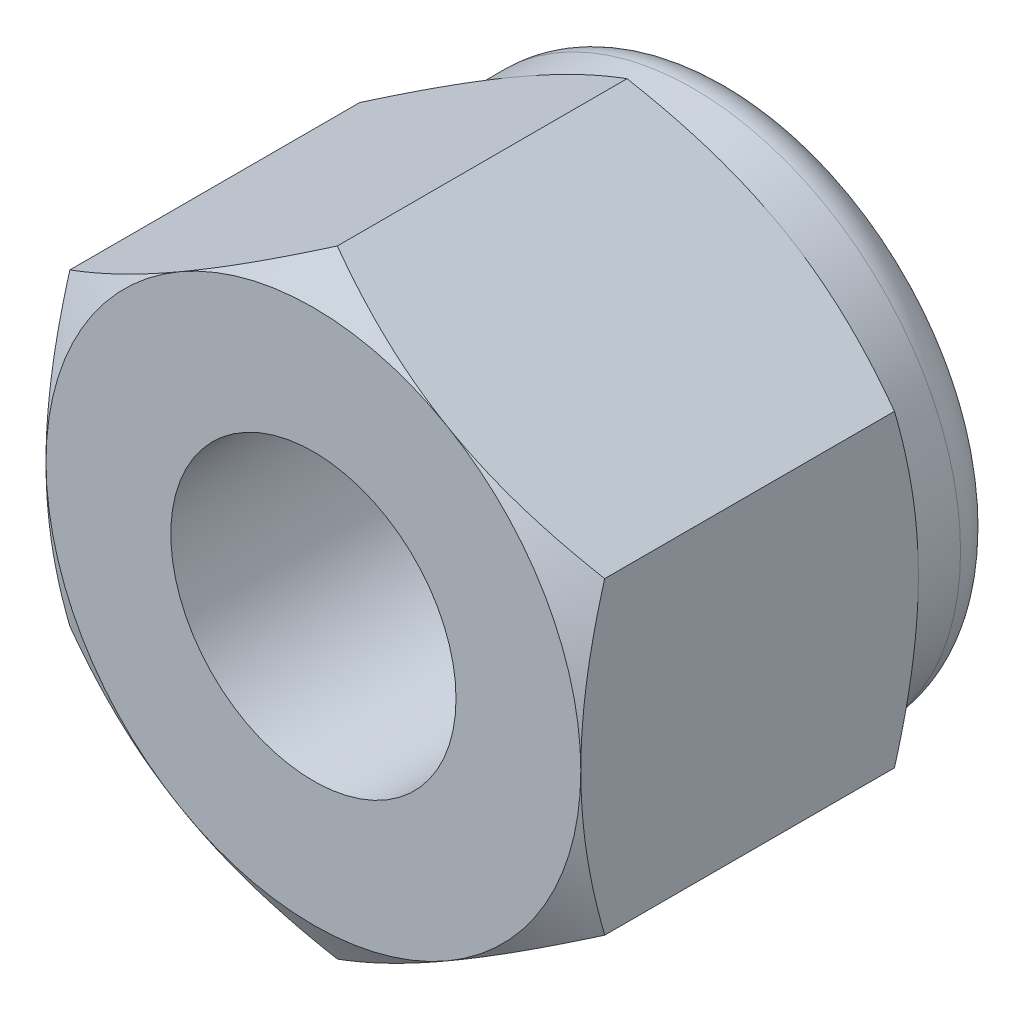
ISO-10303-21;
HEADER;
FILE_DESCRIPTION(('STEP AP214'),'2;1');
FILE_NAME('part.step','',(''),(''),'','','');
FILE_SCHEMA(('AUTOMOTIVE_DESIGN { 1 0 10303 214 1 1 1 1 }'));
ENDSEC;
DATA;
#1=APPLICATION_CONTEXT('core data for automotive mechanical design processes');
#2=APPLICATION_PROTOCOL_DEFINITION('international standard','automotive_design',2000,#1);
#3=PRODUCT_CONTEXT('',#1,'mechanical');
#4=PRODUCT('Part','Part','',(#3));
#5=PRODUCT_RELATED_PRODUCT_CATEGORY('part','',(#4));
#6=PRODUCT_DEFINITION_FORMATION('','',#4);
#7=PRODUCT_DEFINITION_CONTEXT('part definition',#1,'design');
#8=PRODUCT_DEFINITION('design','',#6,#7);
#9=PRODUCT_DEFINITION_SHAPE('','',#8);
#10=(LENGTH_UNIT() NAMED_UNIT(*) SI_UNIT(.MILLI.,.METRE.));
#11=(NAMED_UNIT(*) PLANE_ANGLE_UNIT() SI_UNIT($,.RADIAN.));
#12=(NAMED_UNIT(*) SI_UNIT($,.STERADIAN.) SOLID_ANGLE_UNIT());
#13=UNCERTAINTY_MEASURE_WITH_UNIT(LENGTH_MEASURE(1.E-05),#10,'distance_accuracy_value','');
#14=(GEOMETRIC_REPRESENTATION_CONTEXT(3) GLOBAL_UNCERTAINTY_ASSIGNED_CONTEXT((#13)) GLOBAL_UNIT_ASSIGNED_CONTEXT((#10,
#11,#12)) REPRESENTATION_CONTEXT('',''));
#15=CARTESIAN_POINT('',(0.,0.,0.));
#16=DIRECTION('',(0.,0.,1.));
#17=DIRECTION('',(1.,0.,0.));
#18=AXIS2_PLACEMENT_3D('',#15,#16,#17);
#19=CARTESIAN_POINT('',(-9.,15.5884572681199,0.));
#20=DIRECTION('',(0.,0.,-1.));
#21=DIRECTION('',(-1.,0.,0.));
#22=AXIS2_PLACEMENT_3D('',#19,#20,#21);
#23=PLANE('',#22);
#24=CARTESIAN_POINT('',(0.,0.,0.));
#25=DIRECTION('',(0.,0.,-1.));
#26=DIRECTION('',(-1.,0.,0.));
#27=AXIS2_PLACEMENT_3D('',#24,#25,#26);
#28=CIRCLE('',#27,9.);
#29=CARTESIAN_POINT('',(-9.,0.,0.));
#30=VERTEX_POINT('',#29);
#31=CARTESIAN_POINT('',(-4.5,7.79422863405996,0.));
#32=VERTEX_POINT('',#31);
#33=EDGE_CURVE('E158',#30,#32,#28,.T.);
#34=ORIENTED_EDGE('',*,*,#33,.F.);
#35=CARTESIAN_POINT('',(0.,0.,0.));
#36=DIRECTION('',(0.,0.,-1.));
#37=DIRECTION('',(-1.,0.,0.));
#38=AXIS2_PLACEMENT_3D('',#35,#36,#37);
#39=CIRCLE('',#38,9.);
#40=CARTESIAN_POINT('',(-4.49999999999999,-7.79422863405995,0.));
#41=VERTEX_POINT('',#40);
#42=EDGE_CURVE('E147',#30,#41,#39,.F.);
#43=ORIENTED_EDGE('',*,*,#42,.T.);
#44=CARTESIAN_POINT('',(4.49999999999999,-7.79422863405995,0.));
#45=VERTEX_POINT('',#44);
#46=EDGE_CURVE('E263',#41,#45,#39,.F.);
#47=ORIENTED_EDGE('',*,*,#46,.T.);
#48=CARTESIAN_POINT('',(9.,0.,0.));
#49=VERTEX_POINT('',#48);
#50=EDGE_CURVE('E268',#45,#49,#39,.F.);
#51=ORIENTED_EDGE('',*,*,#50,.T.);
#52=CARTESIAN_POINT('',(4.49999999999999,7.79422863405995,0.));
#53=VERTEX_POINT('',#52);
#54=EDGE_CURVE('E269',#49,#53,#39,.F.);
#55=ORIENTED_EDGE('',*,*,#54,.T.);
#56=EDGE_CURVE('E250',#53,#32,#39,.F.);
#57=ORIENTED_EDGE('',*,*,#56,.T.);
#58=EDGE_LOOP('',(#34,#43,#47,#51,#55,#57));
#59=FACE_BOUND('',#58,.T.);
#60=CARTESIAN_POINT('',(0.,0.,0.));
#61=DIRECTION('',(0.,0.,1.));
#62=DIRECTION('',(1.,0.,0.));
#63=AXIS2_PLACEMENT_3D('',#60,#61,#62);
#64=CIRCLE('',#63,4.8);
#65=CARTESIAN_POINT('',(4.8,0.,0.));
#66=VERTEX_POINT('',#65);
#67=EDGE_CURVE('E547',#66,#66,#64,.T.);
#68=ORIENTED_EDGE('',*,*,#67,.F.);
#69=EDGE_LOOP('',(#68));
#70=FACE_BOUND('',#69,.T.);
#71=ADVANCED_FACE('F34',(#59,#70),#23,.F.);
#72=CARTESIAN_POINT('',(0.,0.,0.));
#73=DIRECTION('',(0.,0.,-1.));
#74=DIRECTION('',(-1.,0.,0.));
#75=AXIS2_PLACEMENT_3D('',#72,#73,#74);
#76=CONICAL_SURFACE('',#75,9.,1.0471975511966);
#77=CARTESIAN_POINT('',(-9.,-14.0653890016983,-4.4446491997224));
#78=CARTESIAN_POINT('',(-9.,-13.6713285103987,-4.25306321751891));
#79=CARTESIAN_POINT('',(-9.,-13.2763748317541,-4.06328348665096));
#80=CARTESIAN_POINT('',(-9.,-12.4842063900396,-3.68835045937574));
#81=CARTESIAN_POINT('',(-9.,-12.0869912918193,-3.50319787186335));
#82=CARTESIAN_POINT('',(-9.,-11.2878306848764,-3.13762483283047));
#83=CARTESIAN_POINT('',(-9.,-10.885871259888,-2.95723469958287));
#84=CARTESIAN_POINT('',(-9.,-10.078792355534,-2.60369545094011));
#85=CARTESIAN_POINT('',(-9.,-9.67367302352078,-2.43054600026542));
#86=CARTESIAN_POINT('',(-9.,-8.84625540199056,-2.08785737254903));
#87=CARTESIAN_POINT('',(-9.,-8.4238299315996,-1.9186236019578));
#88=CARTESIAN_POINT('',(-9.,-7.57407827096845,-1.59270497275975));
#89=CARTESIAN_POINT('',(-9.,-7.14675154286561,-1.43602150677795));
#90=CARTESIAN_POINT('',(-9.,-6.28727729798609,-1.13923741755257));
#91=CARTESIAN_POINT('',(-9.,-5.85514116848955,-0.999104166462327));
#92=CARTESIAN_POINT('',(-9.,-4.98468673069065,-0.739843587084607));
#93=CARTESIAN_POINT('',(-9.,-4.54637038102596,-0.62070975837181));
#94=CARTESIAN_POINT('',(-9.,-3.66563092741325,-0.409725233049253));
#95=CARTESIAN_POINT('',(-9.,-3.22324436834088,-0.317726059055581));
#96=CARTESIAN_POINT('',(-9.,-2.55555164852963,-0.204018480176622));
#97=CARTESIAN_POINT('',(-9.,-2.33228668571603,-0.170163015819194));
#98=CARTESIAN_POINT('',(-9.,-1.88461070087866,-0.111210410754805));
#99=CARTESIAN_POINT('',(-9.,-1.66019979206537,-0.0861124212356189));
#100=CARTESIAN_POINT('',(-9.,-1.21351306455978,-0.0454954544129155));
#101=CARTESIAN_POINT('',(-9.,-0.991248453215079,-0.029853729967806));
#102=CARTESIAN_POINT('',(-9.,-0.546256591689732,-0.00798878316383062));
#103=CARTESIAN_POINT('',(-9.,-0.323529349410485,-0.00176540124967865));
#104=CARTESIAN_POINT('',(-9.,0.12199050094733,0.00111401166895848));
#105=CARTESIAN_POINT('',(-9.,0.344783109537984,-0.00223003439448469));
#106=CARTESIAN_POINT('',(-9.,0.790026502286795,-0.0184024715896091));
#107=CARTESIAN_POINT('',(-9.,1.0124772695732,-0.0312313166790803));
#108=CARTESIAN_POINT('',(-9.,1.54375703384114,-0.0729227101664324));
#109=CARTESIAN_POINT('',(-9.,1.85225489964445,-0.106099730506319));
#110=CARTESIAN_POINT('',(-9.,2.46701766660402,-0.188910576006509));
#111=CARTESIAN_POINT('',(-9.,2.77328227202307,-0.238546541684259));
#112=CARTESIAN_POINT('',(-9.,3.68833555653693,-0.409515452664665));
#113=CARTESIAN_POINT('',(-9.,4.29306527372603,-0.552881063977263));
#114=CARTESIAN_POINT('',(-9.,5.19764184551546,-0.802264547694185));
#115=CARTESIAN_POINT('',(-9.,5.50215678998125,-0.892329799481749));
#116=CARTESIAN_POINT('',(-9.,6.10822983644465,-1.08200162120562));
#117=CARTESIAN_POINT('',(-9.,6.40978791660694,-1.18160826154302));
#118=CARTESIAN_POINT('',(-9.,7.01004150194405,-1.38874893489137));
#119=CARTESIAN_POINT('',(-9.,7.3087378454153,-1.49628056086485));
#120=CARTESIAN_POINT('',(-9.,7.90364018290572,-1.71798708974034));
#121=CARTESIAN_POINT('',(-9.,8.19984622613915,-1.83216186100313));
#122=CARTESIAN_POINT('',(-9.,8.97334628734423,-2.13868688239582));
#123=CARTESIAN_POINT('',(-9.,9.44885064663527,-2.33554814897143));
#124=CARTESIAN_POINT('',(-9.,10.3951846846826,-2.74024038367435));
#125=CARTESIAN_POINT('',(-9.,10.8660139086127,-2.94807240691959));
#126=CARTESIAN_POINT('',(-9.,11.804024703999,-3.37219935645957));
#127=CARTESIAN_POINT('',(-9.,12.2712049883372,-3.58849712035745));
#128=CARTESIAN_POINT('',(-9.,13.202466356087,-4.02760284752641));
#129=CARTESIAN_POINT('',(-9.,13.6665475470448,-4.25041058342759));
#130=CARTESIAN_POINT('',(-9.,14.5928804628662,-4.70149362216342));
#131=CARTESIAN_POINT('',(-9.,15.055128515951,-4.92977645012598));
#132=CARTESIAN_POINT('',(-9.,15.9775681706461,-5.39046131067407));
#133=CARTESIAN_POINT('',(-9.,16.4377597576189,-5.6228633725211));
#134=CARTESIAN_POINT('',(-9.,17.3563529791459,-6.09095503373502));
#135=CARTESIAN_POINT('',(-9.,17.8147549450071,-6.32664398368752));
#136=CARTESIAN_POINT('',(-9.,18.7301433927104,-6.80075634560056));
#137=CARTESIAN_POINT('',(-9.,19.1871298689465,-7.03917976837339));
#138=CARTESIAN_POINT('',(-9.,20.464664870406,-7.70972549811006));
#139=CARTESIAN_POINT('',(-9.,21.2838901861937,-8.1443683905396));
#140=CARTESIAN_POINT('',(-9.,22.9195396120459,-9.01898683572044));
#141=CARTESIAN_POINT('',(-9.,23.7359635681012,-9.45896267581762));
#142=CARTESIAN_POINT('',(-9.,25.3641053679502,-10.3415393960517));
#143=CARTESIAN_POINT('',(-9.,26.1758299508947,-10.7841278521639));
#144=CARTESIAN_POINT('',(-9.,27.3921282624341,-11.4502920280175));
#145=CARTESIAN_POINT('',(-9.,27.7973319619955,-11.6727190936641));
#146=CARTESIAN_POINT('',(-9.,28.6073636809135,-12.1182550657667));
#147=CARTESIAN_POINT('',(-9.,29.0121917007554,-12.3413639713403));
#148=CARTESIAN_POINT('',(-9.,29.4168545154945,-12.5647721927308));
#149=B_SPLINE_CURVE_WITH_KNOTS('',3,(#77,#78,#79,#80,#81,#82,#83,#84,#85,#86,#87,#88,#89,#90,
#91,#92,#93,#94,#95,#96,#97,#98,#99,#100,#101,#102,#103,#104,#105,#106,#107,#108,#109,#110,#111,
#112,#113,#114,#115,#116,#117,#118,#119,#120,#121,#122,#123,#124,#125,#126,#127,#128,#129,#130,
#131,#132,#133,#134,#135,#136,#137,#138,#139,#140,#141,#142,#143,#144,#145,#146,#147,#148),
.UNSPECIFIED.,.F.,.F.,(4,2,2,2,2,2,2,2,2,2,2,2,2,2,2,2,2,2,2,2,2,2,2,2,2,2,2,2,2,2,2,2,2,2,2,4),
(0.,1.31451154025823,2.62922324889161,3.9509101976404,5.27253587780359,6.63757338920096,
8.00276216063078,9.36521294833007,10.7272412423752,12.0816722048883,12.7589793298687,
13.4362207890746,14.1044712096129,14.7727103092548,15.4409547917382,16.1092312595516,
17.0395383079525,17.9699663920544,19.8317773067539,20.7843594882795,21.7369486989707,
22.689249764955,23.6415319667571,25.1852634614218,26.7291436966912,28.27354592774,
29.8178942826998,31.3645029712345,32.9111226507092,34.4574409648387,36.0037653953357,
38.7858925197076,41.568170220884,44.3417926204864,45.7285057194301,47.1152170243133),.UNSPECIFIED.);
#150=CARTESIAN_POINT('',(-9.,5.19615242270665,-0.803847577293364));
#151=VERTEX_POINT('',#150);
#152=EDGE_CURVE('E175',#151,#30,#149,.F.);
#153=ORIENTED_EDGE('',*,*,#152,.T.);
#154=ORIENTED_EDGE('',*,*,#33,.T.);
#155=CARTESIAN_POINT('',(0.000199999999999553,10.3924203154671,-0.803914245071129));
#156=CARTESIAN_POINT('',(-0.197607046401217,10.2782163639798,-0.737982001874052));
#157=CARTESIAN_POINT('',(-0.396185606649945,10.1635669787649,-0.67504140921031));
#158=CARTESIAN_POINT('',(-0.794955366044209,9.93333715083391,-0.555968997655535));
#159=CARTESIAN_POINT('',(-0.99514722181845,9.81775632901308,-0.499840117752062));
#160=CARTESIAN_POINT('',(-1.3975150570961,9.58544915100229,-0.395151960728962));
#161=CARTESIAN_POINT('',(-1.5996945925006,9.46872074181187,-0.346610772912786));
#162=CARTESIAN_POINT('',(-2.00542875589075,9.23447001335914,-0.258148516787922));
#163=CARTESIAN_POINT('',(-2.20898309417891,9.11694786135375,-0.218225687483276));
#164=CARTESIAN_POINT('',(-2.61230590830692,8.88408932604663,-0.148684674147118));
#165=CARTESIAN_POINT('',(-2.812044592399,8.76877014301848,-0.118837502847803));
#166=CARTESIAN_POINT('',(-3.212415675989,8.53761579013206,-0.0687933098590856));
#167=CARTESIAN_POINT('',(-3.41304799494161,8.42178066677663,-0.0485954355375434));
#168=CARTESIAN_POINT('',(-3.81466063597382,8.18990950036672,-0.0183543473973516));
#169=CARTESIAN_POINT('',(-4.01564030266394,8.07387383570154,-0.00829960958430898));
#170=CARTESIAN_POINT('',(-4.41778459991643,7.84169571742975,0.00143766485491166));
#171=CARTESIAN_POINT('',(-4.61894922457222,7.72555326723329,0.00112052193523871));
#172=CARTESIAN_POINT('',(-4.9950326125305,7.50842142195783,-0.00916395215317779));
#173=CARTESIAN_POINT('',(-5.16997789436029,7.40741671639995,-0.0178767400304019));
#174=CARTESIAN_POINT('',(-5.51945867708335,7.20564389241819,-0.042977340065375));
#175=CARTESIAN_POINT('',(-5.69399414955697,7.10487579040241,-0.0593656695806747));
#176=CARTESIAN_POINT('',(-6.21692487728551,6.80296159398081,-0.119656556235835));
#177=CARTESIAN_POINT('',(-6.56439451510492,6.60234990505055,-0.174677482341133));
#178=CARTESIAN_POINT('',(-7.263019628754,6.19899850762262,-0.312230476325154));
#179=CARTESIAN_POINT('',(-7.61408594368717,5.99631027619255,-0.395345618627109));
#180=CARTESIAN_POINT('',(-8.3109833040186,5.59395639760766,-0.583982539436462));
#181=CARTESIAN_POINT('',(-8.65682327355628,5.39428559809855,-0.689460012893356));
#182=CARTESIAN_POINT('',(-9.0002,5.19603695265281,-0.803914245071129));
#183=B_SPLINE_CURVE_WITH_KNOTS('',3,(#155,#156,#157,#158,#159,#160,#161,#162,#163,#164,#165,
#166,#167,#168,#169,#170,#171,#172,#173,#174,#175,#176,#177,#178,#179,#180,#181,#182),
.UNSPECIFIED.,.F.,.F.,(4,2,2,2,2,2,2,2,2,2,2,2,2,4),(0.,0.713219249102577,1.42674513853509,
2.14194697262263,2.8570025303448,3.55449749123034,4.25193080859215,4.94857085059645,
5.64518936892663,6.25162976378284,6.8581110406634,8.07193747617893,9.31268391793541,
10.5509947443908),.UNSPECIFIED.);
#184=EDGE_CURVE('E162',#32,#151,#183,.T.);
#185=ORIENTED_EDGE('',*,*,#184,.T.);
#186=EDGE_LOOP('',(#153,#154,#185));
#187=FACE_BOUND('',#186,.T.);
#188=ADVANCED_FACE('F182',(#187),#76,.T.);
#189=CARTESIAN_POINT('',(9.0002,5.19603695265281,-0.803914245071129));
#190=CARTESIAN_POINT('',(8.80239295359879,5.31024090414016,-0.737982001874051));
#191=CARTESIAN_POINT('',(8.60381439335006,5.42489028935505,-0.675041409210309));
#192=CARTESIAN_POINT('',(8.20504463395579,5.65512011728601,-0.555968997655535));
#193=CARTESIAN_POINT('',(8.00485277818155,5.77070093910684,-0.499840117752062));
#194=CARTESIAN_POINT('',(7.6024849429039,6.00300811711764,-0.395151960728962));
#195=CARTESIAN_POINT('',(7.4003054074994,6.11973652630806,-0.346610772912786));
#196=CARTESIAN_POINT('',(6.99457124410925,6.35398725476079,-0.258148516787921));
#197=CARTESIAN_POINT('',(6.79101690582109,6.47150940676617,-0.218225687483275));
#198=CARTESIAN_POINT('',(6.38769409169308,6.7043679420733,-0.148684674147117));
#199=CARTESIAN_POINT('',(6.18795540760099,6.81968712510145,-0.118837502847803));
#200=CARTESIAN_POINT('',(5.787584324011,7.05084147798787,-0.0687933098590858));
#201=CARTESIAN_POINT('',(5.58695200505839,7.1666766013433,-0.0485954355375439));
#202=CARTESIAN_POINT('',(5.18533936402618,7.3985477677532,-0.0183543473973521));
#203=CARTESIAN_POINT('',(4.98435969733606,7.51458343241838,-0.00829960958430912));
#204=CARTESIAN_POINT('',(4.58221540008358,7.74676155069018,0.0014376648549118));
#205=CARTESIAN_POINT('',(4.38105077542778,7.86290400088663,0.00112052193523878));
#206=CARTESIAN_POINT('',(4.0049673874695,8.08003584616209,-0.00916395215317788));
#207=CARTESIAN_POINT('',(3.83002210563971,8.18104055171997,-0.017876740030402));
#208=CARTESIAN_POINT('',(3.48054132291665,8.38281337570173,-0.0429773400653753));
#209=CARTESIAN_POINT('',(3.30600585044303,8.48358147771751,-0.059365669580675));
#210=CARTESIAN_POINT('',(2.78307512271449,8.78549567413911,-0.119656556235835));
#211=CARTESIAN_POINT('',(2.43560548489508,8.98610736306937,-0.174677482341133));
#212=CARTESIAN_POINT('',(1.736980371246,9.3894587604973,-0.312230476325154));
#213=CARTESIAN_POINT('',(1.38591405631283,9.59214699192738,-0.395345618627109));
#214=CARTESIAN_POINT('',(0.689016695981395,9.99450087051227,-0.583982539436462));
#215=CARTESIAN_POINT('',(0.343176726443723,10.1941716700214,-0.689460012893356));
#216=CARTESIAN_POINT('',(-0.000199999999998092,10.3924203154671,-0.803914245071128));
#217=B_SPLINE_CURVE_WITH_KNOTS('',3,(#189,#190,#191,#192,#193,#194,#195,#196,#197,#198,#199,
#200,#201,#202,#203,#204,#205,#206,#207,#208,#209,#210,#211,#212,#213,#214,#215,#216),
.UNSPECIFIED.,.F.,.F.,(4,2,2,2,2,2,2,2,2,2,2,2,2,4),(0.,0.713219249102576,1.42674513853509,
2.14194697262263,2.85700253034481,3.55449749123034,4.25193080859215,4.94857085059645,
5.64518936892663,6.25162976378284,6.8581110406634,8.07193747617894,9.31268391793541,
10.5509947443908),.UNSPECIFIED.);
#218=CARTESIAN_POINT('',(0.,10.3923048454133,-0.803847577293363));
#219=VERTEX_POINT('',#218);
#220=EDGE_CURVE('E200',#53,#219,#217,.T.);
#221=ORIENTED_EDGE('',*,*,#220,.T.);
#222=EDGE_CURVE('E174',#219,#32,#183,.T.);
#223=ORIENTED_EDGE('',*,*,#222,.T.);
#224=ORIENTED_EDGE('',*,*,#56,.F.);
#225=EDGE_LOOP('',(#221,#223,#224));
#226=FACE_BOUND('',#225,.T.);
#227=ADVANCED_FACE('F187',(#226),#76,.T.);
#228=CARTESIAN_POINT('',(9.,-14.0653890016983,-4.4446491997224));
#229=CARTESIAN_POINT('',(9.,-13.6713285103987,-4.25306321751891));
#230=CARTESIAN_POINT('',(9.,-13.2763748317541,-4.06328348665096));
#231=CARTESIAN_POINT('',(9.,-12.4842063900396,-3.68835045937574));
#232=CARTESIAN_POINT('',(9.,-12.0869912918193,-3.50319787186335));
#233=CARTESIAN_POINT('',(9.,-11.2878306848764,-3.13762483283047));
#234=CARTESIAN_POINT('',(9.,-10.885871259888,-2.95723469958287));
#235=CARTESIAN_POINT('',(9.,-10.078792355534,-2.60369545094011));
#236=CARTESIAN_POINT('',(9.,-9.67367302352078,-2.43054600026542));
#237=CARTESIAN_POINT('',(9.,-8.84625540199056,-2.08785737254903));
#238=CARTESIAN_POINT('',(9.,-8.4238299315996,-1.9186236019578));
#239=CARTESIAN_POINT('',(9.,-7.57407827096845,-1.59270497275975));
#240=CARTESIAN_POINT('',(9.,-7.14675154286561,-1.43602150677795));
#241=CARTESIAN_POINT('',(9.,-6.28727729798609,-1.13923741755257));
#242=CARTESIAN_POINT('',(9.,-5.85514116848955,-0.999104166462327));
#243=CARTESIAN_POINT('',(9.,-4.98468673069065,-0.739843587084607));
#244=CARTESIAN_POINT('',(9.,-4.54637038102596,-0.62070975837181));
#245=CARTESIAN_POINT('',(9.,-3.66563092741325,-0.409725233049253));
#246=CARTESIAN_POINT('',(9.,-3.22324436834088,-0.317726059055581));
#247=CARTESIAN_POINT('',(9.,-2.55555164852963,-0.204018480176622));
#248=CARTESIAN_POINT('',(9.,-2.33228668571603,-0.170163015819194));
#249=CARTESIAN_POINT('',(9.,-1.88461070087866,-0.111210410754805));
#250=CARTESIAN_POINT('',(9.,-1.66019979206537,-0.0861124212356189));
#251=CARTESIAN_POINT('',(9.,-1.21351306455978,-0.0454954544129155));
#252=CARTESIAN_POINT('',(9.,-0.991248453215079,-0.029853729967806));
#253=CARTESIAN_POINT('',(9.,-0.546256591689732,-0.00798878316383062));
#254=CARTESIAN_POINT('',(9.,-0.323529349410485,-0.00176540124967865));
#255=CARTESIAN_POINT('',(9.,0.12199050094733,0.00111401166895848));
#256=CARTESIAN_POINT('',(9.,0.344783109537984,-0.00223003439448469));
#257=CARTESIAN_POINT('',(9.,0.790026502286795,-0.0184024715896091));
#258=CARTESIAN_POINT('',(9.,1.0124772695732,-0.0312313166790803));
#259=CARTESIAN_POINT('',(9.,1.54375703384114,-0.0729227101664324));
#260=CARTESIAN_POINT('',(9.,1.85225489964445,-0.106099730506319));
#261=CARTESIAN_POINT('',(9.,2.46701766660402,-0.188910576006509));
#262=CARTESIAN_POINT('',(9.,2.77328227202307,-0.238546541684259));
#263=CARTESIAN_POINT('',(9.,3.68833555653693,-0.409515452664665));
#264=CARTESIAN_POINT('',(9.,4.29306527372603,-0.552881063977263));
#265=CARTESIAN_POINT('',(9.,5.19764184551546,-0.802264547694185));
#266=CARTESIAN_POINT('',(9.,5.50215678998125,-0.892329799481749));
#267=CARTESIAN_POINT('',(9.,6.10822983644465,-1.08200162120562));
#268=CARTESIAN_POINT('',(9.,6.40978791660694,-1.18160826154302));
#269=CARTESIAN_POINT('',(9.,7.01004150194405,-1.38874893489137));
#270=CARTESIAN_POINT('',(9.,7.3087378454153,-1.49628056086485));
#271=CARTESIAN_POINT('',(9.,7.90364018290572,-1.71798708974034));
#272=CARTESIAN_POINT('',(9.,8.19984622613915,-1.83216186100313));
#273=CARTESIAN_POINT('',(9.,8.97334628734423,-2.13868688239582));
#274=CARTESIAN_POINT('',(9.,9.44885064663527,-2.33554814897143));
#275=CARTESIAN_POINT('',(9.,10.3951846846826,-2.74024038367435));
#276=CARTESIAN_POINT('',(9.,10.8660139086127,-2.94807240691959));
#277=CARTESIAN_POINT('',(9.,11.804024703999,-3.37219935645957));
#278=CARTESIAN_POINT('',(9.,12.2712049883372,-3.58849712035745));
#279=CARTESIAN_POINT('',(9.,13.202466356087,-4.02760284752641));
#280=CARTESIAN_POINT('',(9.,13.6665475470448,-4.25041058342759));
#281=CARTESIAN_POINT('',(9.,14.5928804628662,-4.70149362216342));
#282=CARTESIAN_POINT('',(9.,15.055128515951,-4.92977645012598));
#283=CARTESIAN_POINT('',(9.,15.9775681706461,-5.39046131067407));
#284=CARTESIAN_POINT('',(9.,16.4377597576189,-5.6228633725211));
#285=CARTESIAN_POINT('',(9.,17.3563529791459,-6.09095503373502));
#286=CARTESIAN_POINT('',(9.,17.8147549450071,-6.32664398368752));
#287=CARTESIAN_POINT('',(9.,18.7301433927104,-6.80075634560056));
#288=CARTESIAN_POINT('',(9.,19.1871298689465,-7.03917976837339));
#289=CARTESIAN_POINT('',(9.,20.464664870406,-7.70972549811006));
#290=CARTESIAN_POINT('',(9.,21.2838901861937,-8.1443683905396));
#291=CARTESIAN_POINT('',(9.,22.9195396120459,-9.01898683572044));
#292=CARTESIAN_POINT('',(9.,23.7359635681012,-9.45896267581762));
#293=CARTESIAN_POINT('',(9.,25.3641053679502,-10.3415393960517));
#294=CARTESIAN_POINT('',(9.,26.1758299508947,-10.7841278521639));
#295=CARTESIAN_POINT('',(9.,27.3921282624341,-11.4502920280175));
#296=CARTESIAN_POINT('',(9.,27.7973319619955,-11.6727190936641));
#297=CARTESIAN_POINT('',(9.,28.6073636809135,-12.1182550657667));
#298=CARTESIAN_POINT('',(9.,29.0121917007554,-12.3413639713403));
#299=CARTESIAN_POINT('',(9.,29.4168545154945,-12.5647721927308));
#300=B_SPLINE_CURVE_WITH_KNOTS('',3,(#228,#229,#230,#231,#232,#233,#234,#235,#236,#237,#238,
#239,#240,#241,#242,#243,#244,#245,#246,#247,#248,#249,#250,#251,#252,#253,#254,#255,#256,#257,
#258,#259,#260,#261,#262,#263,#264,#265,#266,#267,#268,#269,#270,#271,#272,#273,#274,#275,#276,
#277,#278,#279,#280,#281,#282,#283,#284,#285,#286,#287,#288,#289,#290,#291,#292,#293,#294,#295,
#296,#297,#298,#299),.UNSPECIFIED.,.F.,.F.,(4,2,2,2,2,2,2,2,2,2,2,2,2,2,2,2,2,2,2,2,2,2,2,2,2,2,
2,2,2,2,2,2,2,2,2,4),(0.,1.31451154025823,2.62922324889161,3.9509101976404,5.27253587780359,
6.63757338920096,8.00276216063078,9.36521294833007,10.7272412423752,12.0816722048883,
12.7589793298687,13.4362207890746,14.1044712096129,14.7727103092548,15.4409547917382,
16.1092312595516,17.0395383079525,17.9699663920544,19.8317773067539,20.7843594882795,
21.7369486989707,22.689249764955,23.6415319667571,25.1852634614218,26.7291436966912,
28.27354592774,29.8178942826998,31.3645029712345,32.9111226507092,34.4574409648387,
36.0037653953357,38.7858925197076,41.568170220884,44.3417926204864,45.7285057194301,
47.1152170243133),.UNSPECIFIED.);
#301=CARTESIAN_POINT('',(9.,5.19615242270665,-0.803847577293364));
#302=VERTEX_POINT('',#301);
#303=EDGE_CURVE('E211',#49,#302,#300,.T.);
#304=ORIENTED_EDGE('',*,*,#303,.T.);
#305=EDGE_CURVE('E288',#302,#53,#217,.T.);
#306=ORIENTED_EDGE('',*,*,#305,.T.);
#307=ORIENTED_EDGE('',*,*,#54,.F.);
#308=EDGE_LOOP('',(#304,#306,#307));
#309=FACE_BOUND('',#308,.T.);
#310=ADVANCED_FACE('F287',(#309),#76,.T.);
#311=CARTESIAN_POINT('',(-0.000199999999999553,-10.3924203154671,-0.803914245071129));
#312=CARTESIAN_POINT('',(0.197607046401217,-10.2782163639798,-0.737982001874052));
#313=CARTESIAN_POINT('',(0.396185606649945,-10.1635669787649,-0.67504140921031));
#314=CARTESIAN_POINT('',(0.794955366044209,-9.93333715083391,-0.555968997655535));
#315=CARTESIAN_POINT('',(0.99514722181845,-9.81775632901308,-0.499840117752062));
#316=CARTESIAN_POINT('',(1.3975150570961,-9.58544915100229,-0.395151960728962));
#317=CARTESIAN_POINT('',(1.5996945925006,-9.46872074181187,-0.346610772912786));
#318=CARTESIAN_POINT('',(2.00542875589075,-9.23447001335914,-0.258148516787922));
#319=CARTESIAN_POINT('',(2.20898309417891,-9.11694786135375,-0.218225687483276));
#320=CARTESIAN_POINT('',(2.61230590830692,-8.88408932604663,-0.148684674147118));
#321=CARTESIAN_POINT('',(2.812044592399,-8.76877014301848,-0.118837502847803));
#322=CARTESIAN_POINT('',(3.212415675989,-8.53761579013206,-0.0687933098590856));
#323=CARTESIAN_POINT('',(3.41304799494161,-8.42178066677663,-0.0485954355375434));
#324=CARTESIAN_POINT('',(3.81466063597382,-8.18990950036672,-0.0183543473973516));
#325=CARTESIAN_POINT('',(4.01564030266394,-8.07387383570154,-0.00829960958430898));
#326=CARTESIAN_POINT('',(4.41778459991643,-7.84169571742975,0.00143766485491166));
#327=CARTESIAN_POINT('',(4.61894922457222,-7.72555326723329,0.00112052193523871));
#328=CARTESIAN_POINT('',(4.9950326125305,-7.50842142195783,-0.00916395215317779));
#329=CARTESIAN_POINT('',(5.16997789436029,-7.40741671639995,-0.0178767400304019));
#330=CARTESIAN_POINT('',(5.51945867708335,-7.20564389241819,-0.042977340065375));
#331=CARTESIAN_POINT('',(5.69399414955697,-7.10487579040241,-0.0593656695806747));
#332=CARTESIAN_POINT('',(6.21692487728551,-6.80296159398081,-0.119656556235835));
#333=CARTESIAN_POINT('',(6.56439451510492,-6.60234990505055,-0.174677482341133));
#334=CARTESIAN_POINT('',(7.263019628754,-6.19899850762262,-0.312230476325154));
#335=CARTESIAN_POINT('',(7.61408594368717,-5.99631027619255,-0.395345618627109));
#336=CARTESIAN_POINT('',(8.3109833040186,-5.59395639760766,-0.583982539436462));
#337=CARTESIAN_POINT('',(8.65682327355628,-5.39428559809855,-0.689460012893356));
#338=CARTESIAN_POINT('',(9.0002,-5.19603695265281,-0.803914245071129));
#339=B_SPLINE_CURVE_WITH_KNOTS('',3,(#311,#312,#313,#314,#315,#316,#317,#318,#319,#320,#321,
#322,#323,#324,#325,#326,#327,#328,#329,#330,#331,#332,#333,#334,#335,#336,#337,#338),
.UNSPECIFIED.,.F.,.F.,(4,2,2,2,2,2,2,2,2,2,2,2,2,4),(0.,0.713219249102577,1.42674513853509,
2.14194697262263,2.8570025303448,3.55449749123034,4.25193080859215,4.94857085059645,
5.64518936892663,6.25162976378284,6.8581110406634,8.07193747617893,9.31268391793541,
10.5509947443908),.UNSPECIFIED.);
#340=CARTESIAN_POINT('',(9.,-5.19615242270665,-0.803847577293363));
#341=VERTEX_POINT('',#340);
#342=EDGE_CURVE('E217',#45,#341,#339,.T.);
#343=ORIENTED_EDGE('',*,*,#342,.T.);
#344=EDGE_CURVE('E216',#341,#49,#300,.T.);
#345=ORIENTED_EDGE('',*,*,#344,.T.);
#346=ORIENTED_EDGE('',*,*,#50,.F.);
#347=EDGE_LOOP('',(#343,#345,#346));
#348=FACE_BOUND('',#347,.T.);
#349=ADVANCED_FACE('F311',(#348),#76,.T.);
#350=CARTESIAN_POINT('',(0.,-10.3923048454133,-0.803847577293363));
#351=VERTEX_POINT('',#350);
#352=EDGE_CURVE('E137',#351,#45,#339,.T.);
#353=ORIENTED_EDGE('',*,*,#352,.T.);
#354=ORIENTED_EDGE('',*,*,#46,.F.);
#355=CARTESIAN_POINT('',(-9.0002,-5.19603695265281,-0.803914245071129));
#356=CARTESIAN_POINT('',(-8.80239295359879,-5.31024090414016,-0.737982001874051));
#357=CARTESIAN_POINT('',(-8.60381439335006,-5.42489028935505,-0.675041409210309));
#358=CARTESIAN_POINT('',(-8.20504463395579,-5.65512011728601,-0.555968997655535));
#359=CARTESIAN_POINT('',(-8.00485277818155,-5.77070093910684,-0.499840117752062));
#360=CARTESIAN_POINT('',(-7.6024849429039,-6.00300811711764,-0.395151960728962));
#361=CARTESIAN_POINT('',(-7.4003054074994,-6.11973652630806,-0.346610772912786));
#362=CARTESIAN_POINT('',(-6.99457124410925,-6.35398725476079,-0.258148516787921));
#363=CARTESIAN_POINT('',(-6.79101690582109,-6.47150940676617,-0.218225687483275));
#364=CARTESIAN_POINT('',(-6.38769409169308,-6.7043679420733,-0.148684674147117));
#365=CARTESIAN_POINT('',(-6.18795540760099,-6.81968712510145,-0.118837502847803));
#366=CARTESIAN_POINT('',(-5.787584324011,-7.05084147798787,-0.0687933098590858));
#367=CARTESIAN_POINT('',(-5.58695200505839,-7.1666766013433,-0.0485954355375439));
#368=CARTESIAN_POINT('',(-5.18533936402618,-7.3985477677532,-0.0183543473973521));
#369=CARTESIAN_POINT('',(-4.98435969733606,-7.51458343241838,-0.00829960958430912));
#370=CARTESIAN_POINT('',(-4.58221540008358,-7.74676155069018,0.0014376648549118));
#371=CARTESIAN_POINT('',(-4.38105077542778,-7.86290400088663,0.00112052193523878));
#372=CARTESIAN_POINT('',(-4.0049673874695,-8.08003584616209,-0.00916395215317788));
#373=CARTESIAN_POINT('',(-3.83002210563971,-8.18104055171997,-0.017876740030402));
#374=CARTESIAN_POINT('',(-3.48054132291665,-8.38281337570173,-0.0429773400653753));
#375=CARTESIAN_POINT('',(-3.30600585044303,-8.48358147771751,-0.059365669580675));
#376=CARTESIAN_POINT('',(-2.78307512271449,-8.78549567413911,-0.119656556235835));
#377=CARTESIAN_POINT('',(-2.43560548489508,-8.98610736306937,-0.174677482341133));
#378=CARTESIAN_POINT('',(-1.736980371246,-9.3894587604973,-0.312230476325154));
#379=CARTESIAN_POINT('',(-1.38591405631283,-9.59214699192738,-0.395345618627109));
#380=CARTESIAN_POINT('',(-0.689016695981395,-9.99450087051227,-0.583982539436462));
#381=CARTESIAN_POINT('',(-0.343176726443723,-10.1941716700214,-0.689460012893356));
#382=CARTESIAN_POINT('',(0.000199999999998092,-10.3924203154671,-0.803914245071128));
#383=B_SPLINE_CURVE_WITH_KNOTS('',3,(#355,#356,#357,#358,#359,#360,#361,#362,#363,#364,#365,
#366,#367,#368,#369,#370,#371,#372,#373,#374,#375,#376,#377,#378,#379,#380,#381,#382),
.UNSPECIFIED.,.F.,.F.,(4,2,2,2,2,2,2,2,2,2,2,2,2,4),(0.,0.713219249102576,1.42674513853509,
2.14194697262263,2.85700253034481,3.55449749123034,4.25193080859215,4.94857085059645,
5.64518936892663,6.25162976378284,6.8581110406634,8.07193747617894,9.31268391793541,
10.5509947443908),.UNSPECIFIED.);
#384=EDGE_CURVE('E308',#41,#351,#383,.T.);
#385=ORIENTED_EDGE('',*,*,#384,.T.);
#386=EDGE_LOOP('',(#353,#354,#385));
#387=FACE_BOUND('',#386,.T.);
#388=ADVANCED_FACE('F189',(#387),#76,.T.);
#389=CARTESIAN_POINT('',(-9.,-5.19615242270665,-0.803847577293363));
#390=VERTEX_POINT('',#389);
#391=EDGE_CURVE('E205',#390,#41,#383,.T.);
#392=ORIENTED_EDGE('',*,*,#391,.T.);
#393=ORIENTED_EDGE('',*,*,#42,.F.);
#394=EDGE_CURVE('E291',#30,#390,#149,.F.);
#395=ORIENTED_EDGE('',*,*,#394,.T.);
#396=EDGE_LOOP('',(#392,#393,#395));
#397=FACE_BOUND('',#396,.T.);
#398=ADVANCED_FACE('F304',(#397),#76,.T.);
#399=CARTESIAN_POINT('',(9.,5.19615242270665,-11.36));
#400=DIRECTION('',(0.499999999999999,0.866025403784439,0.));
#401=DIRECTION('',(-0.866025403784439,0.499999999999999,0.));
#402=AXIS2_PLACEMENT_3D('',#399,#400,#401);
#403=PLANE('',#402);
#404=CARTESIAN_POINT('',(-0.000199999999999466,10.3924203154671,-10.5560857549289));
#405=CARTESIAN_POINT('',(0.197607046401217,10.2782163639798,-10.6220179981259));
#406=CARTESIAN_POINT('',(0.396185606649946,10.1635669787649,-10.6849585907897));
#407=CARTESIAN_POINT('',(0.794955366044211,9.93333715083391,-10.8040310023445));
#408=CARTESIAN_POINT('',(0.995147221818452,9.81775632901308,-10.8601598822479));
#409=CARTESIAN_POINT('',(1.3975150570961,9.58544915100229,-10.964848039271));
#410=CARTESIAN_POINT('',(1.5996945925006,9.46872074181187,-11.0133892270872));
#411=CARTESIAN_POINT('',(2.00542875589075,9.23447001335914,-11.1018514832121));
#412=CARTESIAN_POINT('',(2.20898309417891,9.11694786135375,-11.1417743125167));
#413=CARTESIAN_POINT('',(2.61230590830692,8.88408932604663,-11.2113153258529));
#414=CARTESIAN_POINT('',(2.81204459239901,8.76877014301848,-11.2411624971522));
#415=CARTESIAN_POINT('',(3.212415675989,8.53761579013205,-11.2912066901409));
#416=CARTESIAN_POINT('',(3.41304799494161,8.42178066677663,-11.3114045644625));
#417=CARTESIAN_POINT('',(3.81466063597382,8.18990950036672,-11.3416456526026));
#418=CARTESIAN_POINT('',(4.01564030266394,8.07387383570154,-11.3517003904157));
#419=CARTESIAN_POINT('',(4.41778459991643,7.84169571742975,-11.3614376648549));
#420=CARTESIAN_POINT('',(4.61894922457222,7.72555326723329,-11.3611205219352));
#421=CARTESIAN_POINT('',(4.9950326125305,7.50842142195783,-11.3508360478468));
#422=CARTESIAN_POINT('',(5.16997789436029,7.40741671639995,-11.3421232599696));
#423=CARTESIAN_POINT('',(5.51945867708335,7.20564389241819,-11.3170226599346));
#424=CARTESIAN_POINT('',(5.69399414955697,7.10487579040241,-11.3006343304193));
#425=CARTESIAN_POINT('',(6.21692487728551,6.80296159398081,-11.2403434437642));
#426=CARTESIAN_POINT('',(6.56439451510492,6.60234990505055,-11.1853225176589));
#427=CARTESIAN_POINT('',(7.263019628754,6.19899850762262,-11.0477695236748));
#428=CARTESIAN_POINT('',(7.61408594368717,5.99631027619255,-10.9646543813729));
#429=CARTESIAN_POINT('',(8.31098330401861,5.59395639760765,-10.7760174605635));
#430=CARTESIAN_POINT('',(8.65682327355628,5.39428559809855,-10.6705399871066));
#431=CARTESIAN_POINT('',(9.0002,5.19603695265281,-10.5560857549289));
#432=B_SPLINE_CURVE_WITH_KNOTS('',3,(#404,#405,#406,#407,#408,#409,#410,#411,#412,#413,#414,
#415,#416,#417,#418,#419,#420,#421,#422,#423,#424,#425,#426,#427,#428,#429,#430,#431),
.UNSPECIFIED.,.F.,.F.,(4,2,2,2,2,2,2,2,2,2,2,2,2,4),(0.,0.713219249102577,1.42674513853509,
2.14194697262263,2.85700253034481,3.55449749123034,4.25193080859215,4.94857085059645,
5.64518936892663,6.25162976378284,6.8581110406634,8.07193747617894,9.31268391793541,
10.5509947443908),.UNSPECIFIED.);
#433=CARTESIAN_POINT('',(0.,10.3923048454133,-10.5561524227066));
#434=VERTEX_POINT('',#433);
#435=CARTESIAN_POINT('',(4.49999999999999,7.79422863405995,-11.36));
#436=VERTEX_POINT('',#435);
#437=EDGE_CURVE('E141',#434,#436,#432,.T.);
#438=ORIENTED_EDGE('',*,*,#437,.F.);
#439=DIRECTION('',(0.,0.,1.));
#440=VECTOR('',#439,1.);
#441=CARTESIAN_POINT('',(0.,10.3923048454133,-11.36));
#442=LINE('',#441,#440);
#443=EDGE_CURVE('E134',#434,#219,#442,.T.);
#444=ORIENTED_EDGE('',*,*,#443,.T.);
#445=ORIENTED_EDGE('',*,*,#220,.F.);
#446=ORIENTED_EDGE('',*,*,#305,.F.);
#447=DIRECTION('',(0.,0.,1.));
#448=VECTOR('',#447,1.);
#449=CARTESIAN_POINT('',(9.,5.19615242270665,-11.36));
#450=LINE('',#449,#448);
#451=CARTESIAN_POINT('',(9.,5.19615242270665,-10.5561524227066));
#452=VERTEX_POINT('',#451);
#453=EDGE_CURVE('E247',#452,#302,#450,.T.);
#454=ORIENTED_EDGE('',*,*,#453,.F.);
#455=EDGE_CURVE('E242',#436,#452,#432,.T.);
#456=ORIENTED_EDGE('',*,*,#455,.F.);
#457=EDGE_LOOP('',(#438,#444,#445,#446,#454,#456));
#458=FACE_BOUND('',#457,.T.);
#459=ADVANCED_FACE('F36',(#458),#403,.T.);
#460=CARTESIAN_POINT('',(9.,-5.19615242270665,-11.36));
#461=DIRECTION('',(1.,0.,0.));
#462=DIRECTION('',(0.,0.,-1.));
#463=AXIS2_PLACEMENT_3D('',#460,#461,#462);
#464=PLANE('',#463);
#465=CARTESIAN_POINT('',(9.,-14.0653890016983,-6.91535080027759));
#466=CARTESIAN_POINT('',(9.,-13.6713285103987,-7.10693678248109));
#467=CARTESIAN_POINT('',(9.,-13.2763748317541,-7.29671651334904));
#468=CARTESIAN_POINT('',(9.,-12.4842063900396,-7.67164954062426));
#469=CARTESIAN_POINT('',(9.,-12.0869912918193,-7.85680212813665));
#470=CARTESIAN_POINT('',(9.,-11.2878306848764,-8.22237516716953));
#471=CARTESIAN_POINT('',(9.,-10.885871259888,-8.40276530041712));
#472=CARTESIAN_POINT('',(9.,-10.078792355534,-8.75630454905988));
#473=CARTESIAN_POINT('',(9.,-9.67367302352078,-8.92945399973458));
#474=CARTESIAN_POINT('',(9.,-8.84625540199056,-9.27214262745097));
#475=CARTESIAN_POINT('',(9.,-8.4238299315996,-9.4413763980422));
#476=CARTESIAN_POINT('',(9.,-7.57407827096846,-9.76729502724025));
#477=CARTESIAN_POINT('',(9.,-7.14675154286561,-9.92397849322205));
#478=CARTESIAN_POINT('',(9.,-6.28727729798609,-10.2207625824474));
#479=CARTESIAN_POINT('',(9.,-5.85514116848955,-10.3608958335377));
#480=CARTESIAN_POINT('',(9.,-4.98468673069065,-10.6201564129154));
#481=CARTESIAN_POINT('',(9.,-4.54637038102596,-10.7392902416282));
#482=CARTESIAN_POINT('',(9.,-3.66563092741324,-10.9502747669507));
#483=CARTESIAN_POINT('',(9.,-3.22324436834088,-11.0422739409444));
#484=CARTESIAN_POINT('',(9.,-2.55555164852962,-11.1559815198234));
#485=CARTESIAN_POINT('',(9.,-2.33228668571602,-11.1898369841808));
#486=CARTESIAN_POINT('',(9.,-1.88461070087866,-11.2487895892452));
#487=CARTESIAN_POINT('',(9.,-1.66019979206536,-11.2738875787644));
#488=CARTESIAN_POINT('',(9.,-1.21351306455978,-11.3145045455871));
#489=CARTESIAN_POINT('',(9.,-0.991248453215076,-11.3301462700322));
#490=CARTESIAN_POINT('',(9.,-0.546256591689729,-11.3520112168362));
#491=CARTESIAN_POINT('',(9.,-0.323529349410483,-11.3582345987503));
#492=CARTESIAN_POINT('',(9.,0.121990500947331,-11.361114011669));
#493=CARTESIAN_POINT('',(9.,0.344783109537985,-11.3577699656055));
#494=CARTESIAN_POINT('',(9.,0.790026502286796,-11.3415975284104));
#495=CARTESIAN_POINT('',(9.,1.0124772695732,-11.3287686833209));
#496=CARTESIAN_POINT('',(9.,1.54375703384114,-11.2870772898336));
#497=CARTESIAN_POINT('',(9.,1.85225489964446,-11.2539002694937));
#498=CARTESIAN_POINT('',(9.,2.46701766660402,-11.1710894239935));
#499=CARTESIAN_POINT('',(9.,2.77328227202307,-11.1214534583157));
#500=CARTESIAN_POINT('',(9.,3.68833555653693,-10.9504845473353));
#501=CARTESIAN_POINT('',(9.,4.29306527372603,-10.8071189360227));
#502=CARTESIAN_POINT('',(9.,5.19764184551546,-10.5577354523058));
#503=CARTESIAN_POINT('',(9.,5.50215678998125,-10.4676702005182));
#504=CARTESIAN_POINT('',(9.,6.10822983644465,-10.2779983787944));
#505=CARTESIAN_POINT('',(9.,6.40978791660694,-10.178391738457));
#506=CARTESIAN_POINT('',(9.,7.01004150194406,-9.97125106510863));
#507=CARTESIAN_POINT('',(9.,7.3087378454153,-9.86371943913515));
#508=CARTESIAN_POINT('',(9.,7.90364018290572,-9.64201291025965));
#509=CARTESIAN_POINT('',(9.,8.19984622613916,-9.52783813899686));
#510=CARTESIAN_POINT('',(9.,8.97334628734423,-9.22131311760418));
#511=CARTESIAN_POINT('',(9.,9.44885064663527,-9.02445185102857));
#512=CARTESIAN_POINT('',(9.,10.3951846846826,-8.61975961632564));
#513=CARTESIAN_POINT('',(9.,10.8660139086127,-8.41192759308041));
#514=CARTESIAN_POINT('',(9.,11.804024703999,-7.98780064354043));
#515=CARTESIAN_POINT('',(9.,12.2712049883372,-7.77150287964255));
#516=CARTESIAN_POINT('',(9.,13.202466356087,-7.33239715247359));
#517=CARTESIAN_POINT('',(9.,13.6665475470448,-7.10958941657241));
#518=CARTESIAN_POINT('',(9.,14.5928804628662,-6.65850637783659));
#519=CARTESIAN_POINT('',(9.,15.0551285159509,-6.43022354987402));
#520=CARTESIAN_POINT('',(9.,15.9775681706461,-5.96953868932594));
#521=CARTESIAN_POINT('',(9.,16.4377597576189,-5.7371366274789));
#522=CARTESIAN_POINT('',(9.,17.3563529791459,-5.26904496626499));
#523=CARTESIAN_POINT('',(9.,17.8147549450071,-5.03335601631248));
#524=CARTESIAN_POINT('',(9.,18.7301433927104,-4.55924365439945));
#525=CARTESIAN_POINT('',(9.,19.1871298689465,-4.32082023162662));
#526=CARTESIAN_POINT('',(9.,20.464664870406,-3.65027450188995));
#527=CARTESIAN_POINT('',(9.,21.2838901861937,-3.21563160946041));
#528=CARTESIAN_POINT('',(9.,22.9195396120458,-2.34101316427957));
#529=CARTESIAN_POINT('',(9.,23.7359635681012,-1.90103732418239));
#530=CARTESIAN_POINT('',(9.,25.3641053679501,-1.01846060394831));
#531=CARTESIAN_POINT('',(9.,26.1758299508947,-0.575872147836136));
#532=CARTESIAN_POINT('',(9.,27.3921282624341,0.0902920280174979));
#533=CARTESIAN_POINT('',(9.,27.7973319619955,0.312719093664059));
#534=CARTESIAN_POINT('',(9.,28.6073636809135,0.758255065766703));
#535=CARTESIAN_POINT('',(9.,29.0121917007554,0.98136397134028));
#536=CARTESIAN_POINT('',(9.,29.4168545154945,1.20477219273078));
#537=B_SPLINE_CURVE_WITH_KNOTS('',3,(#465,#466,#467,#468,#469,#470,#471,#472,#473,#474,#475,
#476,#477,#478,#479,#480,#481,#482,#483,#484,#485,#486,#487,#488,#489,#490,#491,#492,#493,#494,
#495,#496,#497,#498,#499,#500,#501,#502,#503,#504,#505,#506,#507,#508,#509,#510,#511,#512,#513,
#514,#515,#516,#517,#518,#519,#520,#521,#522,#523,#524,#525,#526,#527,#528,#529,#530,#531,#532,
#533,#534,#535,#536),.UNSPECIFIED.,.F.,.F.,(4,2,2,2,2,2,2,2,2,2,2,2,2,2,2,2,2,2,2,2,2,2,2,2,2,2,
2,2,2,2,2,2,2,2,2,4),(0.,1.31451154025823,2.62922324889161,3.9509101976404,5.27253587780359,
6.63757338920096,8.00276216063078,9.36521294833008,10.7272412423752,12.0816722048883,
12.7589793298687,13.4362207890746,14.1044712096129,14.7727103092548,15.4409547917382,
16.1092312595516,17.0395383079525,17.9699663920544,19.8317773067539,20.7843594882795,
21.7369486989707,22.689249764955,23.6415319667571,25.1852634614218,26.7291436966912,
28.27354592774,29.8178942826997,31.3645029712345,32.9111226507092,34.4574409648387,
36.0037653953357,38.7858925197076,41.568170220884,44.3417926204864,45.7285057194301,
47.1152170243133),.UNSPECIFIED.);
#538=CARTESIAN_POINT('',(9.,0.,-11.36));
#539=VERTEX_POINT('',#538);
#540=EDGE_CURVE('E236',#452,#539,#537,.F.);
#541=ORIENTED_EDGE('',*,*,#540,.F.);
#542=ORIENTED_EDGE('',*,*,#453,.T.);
#543=ORIENTED_EDGE('',*,*,#303,.F.);
#544=ORIENTED_EDGE('',*,*,#344,.F.);
#545=DIRECTION('',(0.,0.,1.));
#546=VECTOR('',#545,1.);
#547=CARTESIAN_POINT('',(9.,-5.19615242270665,-11.36));
#548=LINE('',#547,#546);
#549=CARTESIAN_POINT('',(9.,-5.19615242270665,-10.5561524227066));
#550=VERTEX_POINT('',#549);
#551=EDGE_CURVE('E251',#550,#341,#548,.T.);
#552=ORIENTED_EDGE('',*,*,#551,.F.);
#553=EDGE_CURVE('E230',#539,#550,#537,.F.);
#554=ORIENTED_EDGE('',*,*,#553,.F.);
#555=EDGE_LOOP('',(#541,#542,#543,#544,#552,#554));
#556=FACE_BOUND('',#555,.T.);
#557=ADVANCED_FACE('F222',(#556),#464,.T.);
#558=CARTESIAN_POINT('',(9.,-5.19615242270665,-11.36));
#559=DIRECTION('',(0.499999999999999,-0.866025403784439,0.));
#560=DIRECTION('',(0.866025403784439,0.499999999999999,0.));
#561=AXIS2_PLACEMENT_3D('',#558,#559,#560);
#562=PLANE('',#561);
#563=CARTESIAN_POINT('',(9.0002,-5.19603695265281,-10.5560857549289));
#564=CARTESIAN_POINT('',(8.80239295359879,-5.31024090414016,-10.6220179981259));
#565=CARTESIAN_POINT('',(8.60381439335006,-5.42489028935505,-10.6849585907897));
#566=CARTESIAN_POINT('',(8.20504463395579,-5.65512011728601,-10.8040310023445));
#567=CARTESIAN_POINT('',(8.00485277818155,-5.77070093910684,-10.8601598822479));
#568=CARTESIAN_POINT('',(7.6024849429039,-6.00300811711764,-10.964848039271));
#569=CARTESIAN_POINT('',(7.4003054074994,-6.11973652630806,-11.0133892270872));
#570=CARTESIAN_POINT('',(6.99457124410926,-6.35398725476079,-11.1018514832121));
#571=CARTESIAN_POINT('',(6.79101690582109,-6.47150940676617,-11.1417743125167));
#572=CARTESIAN_POINT('',(6.38769409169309,-6.70436794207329,-11.2113153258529));
#573=CARTESIAN_POINT('',(6.187955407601,-6.81968712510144,-11.2411624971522));
#574=CARTESIAN_POINT('',(5.787584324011,-7.05084147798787,-11.2912066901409));
#575=CARTESIAN_POINT('',(5.58695200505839,-7.1666766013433,-11.3114045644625));
#576=CARTESIAN_POINT('',(5.18533936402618,-7.3985477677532,-11.3416456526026));
#577=CARTESIAN_POINT('',(4.98435969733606,-7.51458343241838,-11.3517003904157));
#578=CARTESIAN_POINT('',(4.58221540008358,-7.74676155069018,-11.3614376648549));
#579=CARTESIAN_POINT('',(4.38105077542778,-7.86290400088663,-11.3611205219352));
#580=CARTESIAN_POINT('',(4.0049673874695,-8.08003584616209,-11.3508360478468));
#581=CARTESIAN_POINT('',(3.83002210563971,-8.18104055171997,-11.3421232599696));
#582=CARTESIAN_POINT('',(3.48054132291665,-8.38281337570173,-11.3170226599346));
#583=CARTESIAN_POINT('',(3.30600585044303,-8.48358147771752,-11.3006343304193));
#584=CARTESIAN_POINT('',(2.7830751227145,-8.78549567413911,-11.2403434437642));
#585=CARTESIAN_POINT('',(2.43560548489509,-8.98610736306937,-11.1853225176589));
#586=CARTESIAN_POINT('',(1.736980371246,-9.3894587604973,-11.0477695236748));
#587=CARTESIAN_POINT('',(1.38591405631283,-9.59214699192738,-10.9646543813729));
#588=CARTESIAN_POINT('',(0.689016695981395,-9.99450087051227,-10.7760174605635));
#589=CARTESIAN_POINT('',(0.343176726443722,-10.1941716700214,-10.6705399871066));
#590=CARTESIAN_POINT('',(-0.000199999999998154,-10.3924203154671,-10.5560857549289));
#591=B_SPLINE_CURVE_WITH_KNOTS('',3,(#563,#564,#565,#566,#567,#568,#569,#570,#571,#572,#573,
#574,#575,#576,#577,#578,#579,#580,#581,#582,#583,#584,#585,#586,#587,#588,#589,#590),
.UNSPECIFIED.,.F.,.F.,(4,2,2,2,2,2,2,2,2,2,2,2,2,4),(0.,0.713219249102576,1.42674513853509,
2.14194697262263,2.8570025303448,3.55449749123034,4.25193080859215,4.94857085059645,
5.64518936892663,6.25162976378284,6.8581110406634,8.07193747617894,9.31268391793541,
10.5509947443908),.UNSPECIFIED.);
#592=CARTESIAN_POINT('',(4.49999999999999,-7.79422863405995,-11.36));
#593=VERTEX_POINT('',#592);
#594=EDGE_CURVE('E58',#550,#593,#591,.T.);
#595=ORIENTED_EDGE('',*,*,#594,.F.);
#596=ORIENTED_EDGE('',*,*,#551,.T.);
#597=ORIENTED_EDGE('',*,*,#342,.F.);
#598=ORIENTED_EDGE('',*,*,#352,.F.);
#599=DIRECTION('',(0.,0.,1.));
#600=VECTOR('',#599,1.);
#601=CARTESIAN_POINT('',(0.,-10.3923048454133,-11.36));
#602=LINE('',#601,#600);
#603=CARTESIAN_POINT('',(0.,-10.3923048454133,-10.5561524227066));
#604=VERTEX_POINT('',#603);
#605=EDGE_CURVE('E254',#604,#351,#602,.T.);
#606=ORIENTED_EDGE('',*,*,#605,.F.);
#607=EDGE_CURVE('E237',#593,#604,#591,.T.);
#608=ORIENTED_EDGE('',*,*,#607,.F.);
#609=EDGE_LOOP('',(#595,#596,#597,#598,#606,#608));
#610=FACE_BOUND('',#609,.T.);
#611=ADVANCED_FACE('F225',(#610),#562,.T.);
#612=CARTESIAN_POINT('',(-9.,-5.19615242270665,-11.36));
#613=DIRECTION('',(-0.499999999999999,-0.866025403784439,0.));
#614=DIRECTION('',(0.866025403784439,-0.499999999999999,0.));
#615=AXIS2_PLACEMENT_3D('',#612,#613,#614);
#616=PLANE('',#615);
#617=CARTESIAN_POINT('',(0.000199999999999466,-10.3924203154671,-10.5560857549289));
#618=CARTESIAN_POINT('',(-0.197607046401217,-10.2782163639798,-10.6220179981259));
#619=CARTESIAN_POINT('',(-0.396185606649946,-10.1635669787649,-10.6849585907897));
#620=CARTESIAN_POINT('',(-0.794955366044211,-9.93333715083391,-10.8040310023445));
#621=CARTESIAN_POINT('',(-0.995147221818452,-9.81775632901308,-10.8601598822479));
#622=CARTESIAN_POINT('',(-1.3975150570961,-9.58544915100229,-10.964848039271));
#623=CARTESIAN_POINT('',(-1.5996945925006,-9.46872074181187,-11.0133892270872));
#624=CARTESIAN_POINT('',(-2.00542875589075,-9.23447001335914,-11.1018514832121));
#625=CARTESIAN_POINT('',(-2.20898309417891,-9.11694786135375,-11.1417743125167));
#626=CARTESIAN_POINT('',(-2.61230590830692,-8.88408932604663,-11.2113153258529));
#627=CARTESIAN_POINT('',(-2.81204459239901,-8.76877014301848,-11.2411624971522));
#628=CARTESIAN_POINT('',(-3.212415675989,-8.53761579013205,-11.2912066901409));
#629=CARTESIAN_POINT('',(-3.41304799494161,-8.42178066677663,-11.3114045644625));
#630=CARTESIAN_POINT('',(-3.81466063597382,-8.18990950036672,-11.3416456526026));
#631=CARTESIAN_POINT('',(-4.01564030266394,-8.07387383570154,-11.3517003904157));
#632=CARTESIAN_POINT('',(-4.41778459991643,-7.84169571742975,-11.3614376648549));
#633=CARTESIAN_POINT('',(-4.61894922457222,-7.72555326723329,-11.3611205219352));
#634=CARTESIAN_POINT('',(-4.9950326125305,-7.50842142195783,-11.3508360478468));
#635=CARTESIAN_POINT('',(-5.16997789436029,-7.40741671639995,-11.3421232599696));
#636=CARTESIAN_POINT('',(-5.51945867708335,-7.20564389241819,-11.3170226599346));
#637=CARTESIAN_POINT('',(-5.69399414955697,-7.10487579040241,-11.3006343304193));
#638=CARTESIAN_POINT('',(-6.21692487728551,-6.80296159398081,-11.2403434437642));
#639=CARTESIAN_POINT('',(-6.56439451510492,-6.60234990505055,-11.1853225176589));
#640=CARTESIAN_POINT('',(-7.263019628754,-6.19899850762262,-11.0477695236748));
#641=CARTESIAN_POINT('',(-7.61408594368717,-5.99631027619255,-10.9646543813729));
#642=CARTESIAN_POINT('',(-8.31098330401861,-5.59395639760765,-10.7760174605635));
#643=CARTESIAN_POINT('',(-8.65682327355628,-5.39428559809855,-10.6705399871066));
#644=CARTESIAN_POINT('',(-9.0002,-5.19603695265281,-10.5560857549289));
#645=B_SPLINE_CURVE_WITH_KNOTS('',3,(#617,#618,#619,#620,#621,#622,#623,#624,#625,#626,#627,
#628,#629,#630,#631,#632,#633,#634,#635,#636,#637,#638,#639,#640,#641,#642,#643,#644),
.UNSPECIFIED.,.F.,.F.,(4,2,2,2,2,2,2,2,2,2,2,2,2,4),(0.,0.713219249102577,1.42674513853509,
2.14194697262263,2.85700253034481,3.55449749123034,4.25193080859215,4.94857085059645,
5.64518936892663,6.25162976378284,6.8581110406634,8.07193747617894,9.31268391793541,
10.5509947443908),.UNSPECIFIED.);
#646=CARTESIAN_POINT('',(-4.49999999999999,-7.79422863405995,-11.36));
#647=VERTEX_POINT('',#646);
#648=EDGE_CURVE('E51',#604,#647,#645,.T.);
#649=ORIENTED_EDGE('',*,*,#648,.F.);
#650=ORIENTED_EDGE('',*,*,#605,.T.);
#651=ORIENTED_EDGE('',*,*,#384,.F.);
#652=ORIENTED_EDGE('',*,*,#391,.F.);
#653=DIRECTION('',(0.,0.,1.));
#654=VECTOR('',#653,1.);
#655=CARTESIAN_POINT('',(-9.,-5.19615242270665,-11.36));
#656=LINE('',#655,#654);
#657=CARTESIAN_POINT('',(-9.,-5.19615242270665,-10.5561524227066));
#658=VERTEX_POINT('',#657);
#659=EDGE_CURVE('E257',#658,#390,#656,.T.);
#660=ORIENTED_EDGE('',*,*,#659,.F.);
#661=EDGE_CURVE('E320',#647,#658,#645,.T.);
#662=ORIENTED_EDGE('',*,*,#661,.F.);
#663=EDGE_LOOP('',(#649,#650,#651,#652,#660,#662));
#664=FACE_BOUND('',#663,.T.);
#665=ADVANCED_FACE('F306',(#664),#616,.T.);
#666=CARTESIAN_POINT('',(-9.,-5.19615242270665,-11.36));
#667=DIRECTION('',(-1.,0.,0.));
#668=DIRECTION('',(0.,0.,1.));
#669=AXIS2_PLACEMENT_3D('',#666,#667,#668);
#670=PLANE('',#669);
#671=CARTESIAN_POINT('',(-9.,-14.0653890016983,-6.91535080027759));
#672=CARTESIAN_POINT('',(-9.,-13.6713285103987,-7.10693678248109));
#673=CARTESIAN_POINT('',(-9.,-13.2763748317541,-7.29671651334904));
#674=CARTESIAN_POINT('',(-9.,-12.4842063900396,-7.67164954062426));
#675=CARTESIAN_POINT('',(-9.,-12.0869912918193,-7.85680212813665));
#676=CARTESIAN_POINT('',(-9.,-11.2878306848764,-8.22237516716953));
#677=CARTESIAN_POINT('',(-9.,-10.885871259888,-8.40276530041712));
#678=CARTESIAN_POINT('',(-9.,-10.078792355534,-8.75630454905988));
#679=CARTESIAN_POINT('',(-9.,-9.67367302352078,-8.92945399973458));
#680=CARTESIAN_POINT('',(-9.,-8.84625540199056,-9.27214262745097));
#681=CARTESIAN_POINT('',(-9.,-8.4238299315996,-9.4413763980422));
#682=CARTESIAN_POINT('',(-9.,-7.57407827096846,-9.76729502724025));
#683=CARTESIAN_POINT('',(-9.,-7.14675154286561,-9.92397849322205));
#684=CARTESIAN_POINT('',(-9.,-6.28727729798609,-10.2207625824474));
#685=CARTESIAN_POINT('',(-9.,-5.85514116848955,-10.3608958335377));
#686=CARTESIAN_POINT('',(-9.,-4.98468673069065,-10.6201564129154));
#687=CARTESIAN_POINT('',(-9.,-4.54637038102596,-10.7392902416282));
#688=CARTESIAN_POINT('',(-9.,-3.66563092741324,-10.9502747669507));
#689=CARTESIAN_POINT('',(-9.,-3.22324436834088,-11.0422739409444));
#690=CARTESIAN_POINT('',(-9.,-2.55555164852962,-11.1559815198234));
#691=CARTESIAN_POINT('',(-9.,-2.33228668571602,-11.1898369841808));
#692=CARTESIAN_POINT('',(-9.,-1.88461070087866,-11.2487895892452));
#693=CARTESIAN_POINT('',(-9.,-1.66019979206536,-11.2738875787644));
#694=CARTESIAN_POINT('',(-9.,-1.21351306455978,-11.3145045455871));
#695=CARTESIAN_POINT('',(-9.,-0.991248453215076,-11.3301462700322));
#696=CARTESIAN_POINT('',(-9.,-0.546256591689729,-11.3520112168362));
#697=CARTESIAN_POINT('',(-9.,-0.323529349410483,-11.3582345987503));
#698=CARTESIAN_POINT('',(-9.,0.121990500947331,-11.361114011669));
#699=CARTESIAN_POINT('',(-9.,0.344783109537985,-11.3577699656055));
#700=CARTESIAN_POINT('',(-9.,0.790026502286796,-11.3415975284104));
#701=CARTESIAN_POINT('',(-9.,1.0124772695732,-11.3287686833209));
#702=CARTESIAN_POINT('',(-9.,1.54375703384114,-11.2870772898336));
#703=CARTESIAN_POINT('',(-9.,1.85225489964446,-11.2539002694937));
#704=CARTESIAN_POINT('',(-9.,2.46701766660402,-11.1710894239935));
#705=CARTESIAN_POINT('',(-9.,2.77328227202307,-11.1214534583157));
#706=CARTESIAN_POINT('',(-9.,3.68833555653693,-10.9504845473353));
#707=CARTESIAN_POINT('',(-9.,4.29306527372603,-10.8071189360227));
#708=CARTESIAN_POINT('',(-9.,5.19764184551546,-10.5577354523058));
#709=CARTESIAN_POINT('',(-9.,5.50215678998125,-10.4676702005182));
#710=CARTESIAN_POINT('',(-9.,6.10822983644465,-10.2779983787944));
#711=CARTESIAN_POINT('',(-9.,6.40978791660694,-10.178391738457));
#712=CARTESIAN_POINT('',(-9.,7.01004150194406,-9.97125106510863));
#713=CARTESIAN_POINT('',(-9.,7.3087378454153,-9.86371943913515));
#714=CARTESIAN_POINT('',(-9.,7.90364018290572,-9.64201291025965));
#715=CARTESIAN_POINT('',(-9.,8.19984622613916,-9.52783813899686));
#716=CARTESIAN_POINT('',(-9.,8.97334628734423,-9.22131311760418));
#717=CARTESIAN_POINT('',(-9.,9.44885064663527,-9.02445185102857));
#718=CARTESIAN_POINT('',(-9.,10.3951846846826,-8.61975961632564));
#719=CARTESIAN_POINT('',(-9.,10.8660139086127,-8.41192759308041));
#720=CARTESIAN_POINT('',(-9.,11.804024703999,-7.98780064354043));
#721=CARTESIAN_POINT('',(-9.,12.2712049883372,-7.77150287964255));
#722=CARTESIAN_POINT('',(-9.,13.202466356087,-7.33239715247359));
#723=CARTESIAN_POINT('',(-9.,13.6665475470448,-7.10958941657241));
#724=CARTESIAN_POINT('',(-9.,14.5928804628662,-6.65850637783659));
#725=CARTESIAN_POINT('',(-9.,15.0551285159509,-6.43022354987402));
#726=CARTESIAN_POINT('',(-9.,15.9775681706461,-5.96953868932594));
#727=CARTESIAN_POINT('',(-9.,16.4377597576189,-5.7371366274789));
#728=CARTESIAN_POINT('',(-9.,17.3563529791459,-5.26904496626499));
#729=CARTESIAN_POINT('',(-9.,17.8147549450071,-5.03335601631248));
#730=CARTESIAN_POINT('',(-9.,18.7301433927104,-4.55924365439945));
#731=CARTESIAN_POINT('',(-9.,19.1871298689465,-4.32082023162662));
#732=CARTESIAN_POINT('',(-9.,20.464664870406,-3.65027450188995));
#733=CARTESIAN_POINT('',(-9.,21.2838901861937,-3.21563160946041));
#734=CARTESIAN_POINT('',(-9.,22.9195396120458,-2.34101316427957));
#735=CARTESIAN_POINT('',(-9.,23.7359635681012,-1.90103732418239));
#736=CARTESIAN_POINT('',(-9.,25.3641053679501,-1.01846060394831));
#737=CARTESIAN_POINT('',(-9.,26.1758299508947,-0.575872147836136));
#738=CARTESIAN_POINT('',(-9.,27.3921282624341,0.0902920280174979));
#739=CARTESIAN_POINT('',(-9.,27.7973319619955,0.312719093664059));
#740=CARTESIAN_POINT('',(-9.,28.6073636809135,0.758255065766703));
#741=CARTESIAN_POINT('',(-9.,29.0121917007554,0.98136397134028));
#742=CARTESIAN_POINT('',(-9.,29.4168545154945,1.20477219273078));
#743=B_SPLINE_CURVE_WITH_KNOTS('',3,(#671,#672,#673,#674,#675,#676,#677,#678,#679,#680,#681,
#682,#683,#684,#685,#686,#687,#688,#689,#690,#691,#692,#693,#694,#695,#696,#697,#698,#699,#700,
#701,#702,#703,#704,#705,#706,#707,#708,#709,#710,#711,#712,#713,#714,#715,#716,#717,#718,#719,
#720,#721,#722,#723,#724,#725,#726,#727,#728,#729,#730,#731,#732,#733,#734,#735,#736,#737,#738,
#739,#740,#741,#742),.UNSPECIFIED.,.F.,.F.,(4,2,2,2,2,2,2,2,2,2,2,2,2,2,2,2,2,2,2,2,2,2,2,2,2,2,
2,2,2,2,2,2,2,2,2,4),(0.,1.31451154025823,2.62922324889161,3.9509101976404,5.27253587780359,
6.63757338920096,8.00276216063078,9.36521294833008,10.7272412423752,12.0816722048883,
12.7589793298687,13.4362207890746,14.1044712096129,14.7727103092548,15.4409547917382,
16.1092312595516,17.0395383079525,17.9699663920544,19.8317773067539,20.7843594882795,
21.7369486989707,22.689249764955,23.6415319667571,25.1852634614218,26.7291436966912,
28.27354592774,29.8178942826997,31.3645029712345,32.9111226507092,34.4574409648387,
36.0037653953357,38.7858925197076,41.568170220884,44.3417926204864,45.7285057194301,
47.1152170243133),.UNSPECIFIED.);
#744=CARTESIAN_POINT('',(-9.,0.,-11.36));
#745=VERTEX_POINT('',#744);
#746=EDGE_CURVE('E321',#658,#745,#743,.T.);
#747=ORIENTED_EDGE('',*,*,#746,.F.);
#748=ORIENTED_EDGE('',*,*,#659,.T.);
#749=ORIENTED_EDGE('',*,*,#394,.F.);
#750=ORIENTED_EDGE('',*,*,#152,.F.);
#751=DIRECTION('',(0.,0.,1.));
#752=VECTOR('',#751,1.);
#753=CARTESIAN_POINT('',(-9.,5.19615242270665,-11.36));
#754=LINE('',#753,#752);
#755=CARTESIAN_POINT('',(-9.,5.19615242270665,-10.5561524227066));
#756=VERTEX_POINT('',#755);
#757=EDGE_CURVE('E260',#756,#151,#754,.T.);
#758=ORIENTED_EDGE('',*,*,#757,.F.);
#759=EDGE_CURVE('E153',#745,#756,#743,.T.);
#760=ORIENTED_EDGE('',*,*,#759,.F.);
#761=EDGE_LOOP('',(#747,#748,#749,#750,#758,#760));
#762=FACE_BOUND('',#761,.T.);
#763=ADVANCED_FACE('F300',(#762),#670,.T.);
#764=CARTESIAN_POINT('',(-9.,5.19615242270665,-11.36));
#765=DIRECTION('',(-0.499999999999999,0.866025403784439,0.));
#766=DIRECTION('',(-0.866025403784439,-0.499999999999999,0.));
#767=AXIS2_PLACEMENT_3D('',#764,#765,#766);
#768=PLANE('',#767);
#769=CARTESIAN_POINT('',(-9.0002,5.19603695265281,-10.5560857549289));
#770=CARTESIAN_POINT('',(-8.80239295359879,5.31024090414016,-10.6220179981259));
#771=CARTESIAN_POINT('',(-8.60381439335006,5.42489028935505,-10.6849585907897));
#772=CARTESIAN_POINT('',(-8.20504463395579,5.65512011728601,-10.8040310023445));
#773=CARTESIAN_POINT('',(-8.00485277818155,5.77070093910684,-10.8601598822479));
#774=CARTESIAN_POINT('',(-7.6024849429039,6.00300811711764,-10.964848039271));
#775=CARTESIAN_POINT('',(-7.4003054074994,6.11973652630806,-11.0133892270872));
#776=CARTESIAN_POINT('',(-6.99457124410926,6.35398725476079,-11.1018514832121));
#777=CARTESIAN_POINT('',(-6.79101690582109,6.47150940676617,-11.1417743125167));
#778=CARTESIAN_POINT('',(-6.38769409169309,6.70436794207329,-11.2113153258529));
#779=CARTESIAN_POINT('',(-6.187955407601,6.81968712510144,-11.2411624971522));
#780=CARTESIAN_POINT('',(-5.787584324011,7.05084147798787,-11.2912066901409));
#781=CARTESIAN_POINT('',(-5.58695200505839,7.1666766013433,-11.3114045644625));
#782=CARTESIAN_POINT('',(-5.18533936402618,7.3985477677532,-11.3416456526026));
#783=CARTESIAN_POINT('',(-4.98435969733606,7.51458343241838,-11.3517003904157));
#784=CARTESIAN_POINT('',(-4.58221540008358,7.74676155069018,-11.3614376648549));
#785=CARTESIAN_POINT('',(-4.38105077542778,7.86290400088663,-11.3611205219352));
#786=CARTESIAN_POINT('',(-4.0049673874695,8.08003584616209,-11.3508360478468));
#787=CARTESIAN_POINT('',(-3.83002210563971,8.18104055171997,-11.3421232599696));
#788=CARTESIAN_POINT('',(-3.48054132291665,8.38281337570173,-11.3170226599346));
#789=CARTESIAN_POINT('',(-3.30600585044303,8.48358147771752,-11.3006343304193));
#790=CARTESIAN_POINT('',(-2.7830751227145,8.78549567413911,-11.2403434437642));
#791=CARTESIAN_POINT('',(-2.43560548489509,8.98610736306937,-11.1853225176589));
#792=CARTESIAN_POINT('',(-1.736980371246,9.3894587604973,-11.0477695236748));
#793=CARTESIAN_POINT('',(-1.38591405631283,9.59214699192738,-10.9646543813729));
#794=CARTESIAN_POINT('',(-0.689016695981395,9.99450087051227,-10.7760174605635));
#795=CARTESIAN_POINT('',(-0.343176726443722,10.1941716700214,-10.6705399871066));
#796=CARTESIAN_POINT('',(0.000199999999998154,10.3924203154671,-10.5560857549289));
#797=B_SPLINE_CURVE_WITH_KNOTS('',3,(#769,#770,#771,#772,#773,#774,#775,#776,#777,#778,#779,
#780,#781,#782,#783,#784,#785,#786,#787,#788,#789,#790,#791,#792,#793,#794,#795,#796),
.UNSPECIFIED.,.F.,.F.,(4,2,2,2,2,2,2,2,2,2,2,2,2,4),(0.,0.713219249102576,1.42674513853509,
2.14194697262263,2.8570025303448,3.55449749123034,4.25193080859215,4.94857085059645,
5.64518936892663,6.25162976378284,6.8581110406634,8.07193747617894,9.31268391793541,
10.5509947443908),.UNSPECIFIED.);
#798=CARTESIAN_POINT('',(-4.5,7.79422863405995,-11.36));
#799=VERTEX_POINT('',#798);
#800=EDGE_CURVE('E130',#756,#799,#797,.T.);
#801=ORIENTED_EDGE('',*,*,#800,.F.);
#802=ORIENTED_EDGE('',*,*,#757,.T.);
#803=ORIENTED_EDGE('',*,*,#184,.F.);
#804=ORIENTED_EDGE('',*,*,#222,.F.);
#805=ORIENTED_EDGE('',*,*,#443,.F.);
#806=EDGE_CURVE('E125',#799,#434,#797,.T.);
#807=ORIENTED_EDGE('',*,*,#806,.F.);
#808=EDGE_LOOP('',(#801,#802,#803,#804,#805,#807));
#809=FACE_BOUND('',#808,.T.);
#810=ADVANCED_FACE('F127',(#809),#768,.T.);
#811=CARTESIAN_POINT('',(0.,0.,-5.68));
#812=DIRECTION('',(0.,0.,1.));
#813=DIRECTION('',(1.,0.,0.));
#814=AXIS2_PLACEMENT_3D('',#811,#812,#813);
#815=CONICAL_SURFACE('',#814,18.8380485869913,1.0471975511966);
#816=ORIENTED_EDGE('',*,*,#759,.T.);
#817=ORIENTED_EDGE('',*,*,#800,.T.);
#818=CARTESIAN_POINT('',(0.,0.,-11.36));
#819=DIRECTION('',(0.,0.,-1.));
#820=DIRECTION('',(-1.,0.,0.));
#821=AXIS2_PLACEMENT_3D('',#818,#819,#820);
#822=CIRCLE('',#821,9.);
#823=EDGE_CURVE('E151',#745,#799,#822,.T.);
#824=ORIENTED_EDGE('',*,*,#823,.F.);
#825=EDGE_LOOP('',(#816,#817,#824));
#826=FACE_BOUND('',#825,.T.);
#827=ADVANCED_FACE('F150',(#826),#815,.T.);
#828=ORIENTED_EDGE('',*,*,#437,.T.);
#829=CARTESIAN_POINT('',(0.,0.,-11.36));
#830=DIRECTION('',(0.,0.,-1.));
#831=DIRECTION('',(-1.,0.,0.));
#832=AXIS2_PLACEMENT_3D('',#829,#830,#831);
#833=CIRCLE('',#832,9.);
#834=EDGE_CURVE('E44',#436,#799,#833,.F.);
#835=ORIENTED_EDGE('',*,*,#834,.T.);
#836=ORIENTED_EDGE('',*,*,#806,.T.);
#837=EDGE_LOOP('',(#828,#835,#836));
#838=FACE_BOUND('',#837,.T.);
#839=ADVANCED_FACE('F140',(#838),#815,.T.);
#840=ORIENTED_EDGE('',*,*,#455,.T.);
#841=ORIENTED_EDGE('',*,*,#540,.T.);
#842=EDGE_CURVE('E146',#539,#436,#833,.F.);
#843=ORIENTED_EDGE('',*,*,#842,.T.);
#844=EDGE_LOOP('',(#840,#841,#843));
#845=FACE_BOUND('',#844,.T.);
#846=ADVANCED_FACE('F413',(#845),#815,.T.);
#847=ORIENTED_EDGE('',*,*,#553,.T.);
#848=ORIENTED_EDGE('',*,*,#594,.T.);
#849=EDGE_CURVE('E317',#593,#539,#833,.F.);
#850=ORIENTED_EDGE('',*,*,#849,.T.);
#851=EDGE_LOOP('',(#847,#848,#850));
#852=FACE_BOUND('',#851,.T.);
#853=ADVANCED_FACE('F421',(#852),#815,.T.);
#854=ORIENTED_EDGE('',*,*,#607,.T.);
#855=ORIENTED_EDGE('',*,*,#648,.T.);
#856=EDGE_CURVE('E43',#647,#593,#833,.F.);
#857=ORIENTED_EDGE('',*,*,#856,.T.);
#858=EDGE_LOOP('',(#854,#855,#857));
#859=FACE_BOUND('',#858,.T.);
#860=ADVANCED_FACE('F319',(#859),#815,.T.);
#861=ORIENTED_EDGE('',*,*,#661,.T.);
#862=ORIENTED_EDGE('',*,*,#746,.T.);
#863=EDGE_CURVE('E11',#745,#647,#833,.F.);
#864=ORIENTED_EDGE('',*,*,#863,.T.);
#865=EDGE_LOOP('',(#861,#862,#864));
#866=FACE_BOUND('',#865,.T.);
#867=ADVANCED_FACE('F405',(#866),#815,.T.);
#868=CARTESIAN_POINT('',(0.,0.,0.));
#869=DIRECTION('',(0.,0.,1.));
#870=DIRECTION('',(1.,0.,0.));
#871=AXIS2_PLACEMENT_3D('',#868,#869,#870);
#872=CYLINDRICAL_SURFACE('',#871,5.19615242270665);
#873=CARTESIAN_POINT('',(0.,0.,-13.0166666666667));
#874=DIRECTION('',(0.,0.,1.));
#875=DIRECTION('',(1.,0.,0.));
#876=AXIS2_PLACEMENT_3D('',#873,#874,#875);
#877=CIRCLE('',#876,5.19615242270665);
#878=CARTESIAN_POINT('',(5.19615242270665,0.,-13.0166666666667));
#879=VERTEX_POINT('',#878);
#880=EDGE_CURVE('E159',#879,#879,#877,.T.);
#881=ORIENTED_EDGE('',*,*,#880,.F.);
#882=EDGE_LOOP('',(#881));
#883=FACE_BOUND('',#882,.T.);
#884=CARTESIAN_POINT('',(0.,0.,-11.36));
#885=DIRECTION('',(0.,0.,-1.));
#886=DIRECTION('',(-1.,0.,0.));
#887=AXIS2_PLACEMENT_3D('',#884,#885,#886);
#888=CIRCLE('',#887,5.19615242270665);
#889=CARTESIAN_POINT('',(-5.19615242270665,0.,-11.36));
#890=VERTEX_POINT('',#889);
#891=EDGE_CURVE('E551',#890,#890,#888,.F.);
#892=ORIENTED_EDGE('',*,*,#891,.T.);
#893=EDGE_LOOP('',(#892));
#894=FACE_BOUND('',#893,.T.);
#895=ADVANCED_FACE('F190',(#883,#894),#872,.F.);
#896=CARTESIAN_POINT('',(0.,7.09807621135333,-13.0166666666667));
#897=DIRECTION('',(0.,0.,1.));
#898=DIRECTION('',(1.,0.,0.));
#899=AXIS2_PLACEMENT_3D('',#896,#897,#898);
#900=PLANE('',#899);
#901=CARTESIAN_POINT('',(0.,0.,-13.0166666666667));
#902=DIRECTION('',(0.,0.,1.));
#903=DIRECTION('',(1.,0.,0.));
#904=AXIS2_PLACEMENT_3D('',#901,#902,#903);
#905=CIRCLE('',#904,7.09807621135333);
#906=CARTESIAN_POINT('',(7.09807621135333,0.,-13.0166666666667));
#907=VERTEX_POINT('',#906);
#908=EDGE_CURVE('E165',#907,#907,#905,.T.);
#909=ORIENTED_EDGE('',*,*,#908,.F.);
#910=EDGE_LOOP('',(#909));
#911=FACE_BOUND('',#910,.T.);
#912=ORIENTED_EDGE('',*,*,#880,.T.);
#913=EDGE_LOOP('',(#912));
#914=FACE_BOUND('',#913,.T.);
#915=ADVANCED_FACE('F452',(#911,#914),#900,.F.);
#916=CARTESIAN_POINT('',(0.,0.,0.));
#917=DIRECTION('',(0.,0.,1.));
#918=DIRECTION('',(1.,0.,0.));
#919=AXIS2_PLACEMENT_3D('',#916,#917,#918);
#920=CYLINDRICAL_SURFACE('',#919,7.09807621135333);
#921=CARTESIAN_POINT('',(0.,0.,-14.2));
#922=DIRECTION('',(0.,0.,1.));
#923=DIRECTION('',(1.,0.,0.));
#924=AXIS2_PLACEMENT_3D('',#921,#922,#923);
#925=CIRCLE('',#924,7.09807621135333);
#926=CARTESIAN_POINT('',(7.09807621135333,0.,-14.2));
#927=VERTEX_POINT('',#926);
#928=EDGE_CURVE('E563',#927,#927,#925,.T.);
#929=ORIENTED_EDGE('',*,*,#928,.F.);
#930=EDGE_LOOP('',(#929));
#931=FACE_BOUND('',#930,.T.);
#932=ORIENTED_EDGE('',*,*,#908,.T.);
#933=EDGE_LOOP('',(#932));
#934=FACE_BOUND('',#933,.T.);
#935=ADVANCED_FACE('F463',(#931,#934),#920,.F.);
#936=CARTESIAN_POINT('',(0.,7.58,-14.2));
#937=DIRECTION('',(0.,0.,1.));
#938=DIRECTION('',(1.,0.,0.));
#939=AXIS2_PLACEMENT_3D('',#936,#937,#938);
#940=PLANE('',#939);
#941=CARTESIAN_POINT('',(0.,0.,-14.2));
#942=DIRECTION('',(0.,0.,1.));
#943=DIRECTION('',(1.,0.,0.));
#944=AXIS2_PLACEMENT_3D('',#941,#942,#943);
#945=CIRCLE('',#944,7.58);
#946=CARTESIAN_POINT('',(7.58,0.,-14.2));
#947=VERTEX_POINT('',#946);
#948=EDGE_CURVE('E560',#947,#947,#945,.T.);
#949=ORIENTED_EDGE('',*,*,#948,.F.);
#950=EDGE_LOOP('',(#949));
#951=FACE_BOUND('',#950,.T.);
#952=ORIENTED_EDGE('',*,*,#928,.T.);
#953=EDGE_LOOP('',(#952));
#954=FACE_BOUND('',#953,.T.);
#955=ADVANCED_FACE('F472',(#951,#954),#940,.F.);
#956=CARTESIAN_POINT('',(0.,0.,-12.78));
#957=DIRECTION('',(0.,0.,1.));
#958=DIRECTION('',(1.,0.,0.));
#959=AXIS2_PLACEMENT_3D('',#956,#957,#958);
#960=TOROIDAL_SURFACE('',#959,7.58,1.42);
#961=CARTESIAN_POINT('',(0.,0.,-12.78));
#962=DIRECTION('',(0.,0.,1.));
#963=DIRECTION('',(1.,0.,0.));
#964=AXIS2_PLACEMENT_3D('',#961,#962,#963);
#965=CIRCLE('',#964,9.);
#966=CARTESIAN_POINT('',(9.,0.,-12.78));
#967=VERTEX_POINT('',#966);
#968=EDGE_CURVE('E554',#967,#967,#965,.T.);
#969=ORIENTED_EDGE('',*,*,#968,.F.);
#970=EDGE_LOOP('',(#969));
#971=FACE_BOUND('',#970,.T.);
#972=ORIENTED_EDGE('',*,*,#948,.T.);
#973=EDGE_LOOP('',(#972));
#974=FACE_BOUND('',#973,.T.);
#975=ADVANCED_FACE('F482',(#971,#974),#960,.T.);
#976=CARTESIAN_POINT('',(0.,0.,0.));
#977=DIRECTION('',(0.,0.,1.));
#978=DIRECTION('',(1.,0.,0.));
#979=AXIS2_PLACEMENT_3D('',#976,#977,#978);
#980=CYLINDRICAL_SURFACE('',#979,9.);
#981=ORIENTED_EDGE('',*,*,#842,.F.);
#982=ORIENTED_EDGE('',*,*,#849,.F.);
#983=ORIENTED_EDGE('',*,*,#856,.F.);
#984=ORIENTED_EDGE('',*,*,#863,.F.);
#985=ORIENTED_EDGE('',*,*,#823,.T.);
#986=ORIENTED_EDGE('',*,*,#834,.F.);
#987=EDGE_LOOP('',(#981,#982,#983,#984,#985,#986));
#988=FACE_BOUND('',#987,.T.);
#989=ORIENTED_EDGE('',*,*,#968,.T.);
#990=EDGE_LOOP('',(#989));
#991=FACE_BOUND('',#990,.T.);
#992=ADVANCED_FACE('F155',(#988,#991),#980,.T.);
#993=CARTESIAN_POINT('',(0.,5.19615242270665,-11.36));
#994=DIRECTION('',(0.,0.,-1.));
#995=DIRECTION('',(-1.,0.,0.));
#996=AXIS2_PLACEMENT_3D('',#993,#994,#995);
#997=PLANE('',#996);
#998=CARTESIAN_POINT('',(0.,0.,-11.36));
#999=DIRECTION('',(0.,0.,-1.));
#1000=DIRECTION('',(-1.,0.,0.));
#1001=AXIS2_PLACEMENT_3D('',#998,#999,#1000);
#1002=CIRCLE('',#1001,4.8);
#1003=CARTESIAN_POINT('',(-4.8,0.,-11.36));
#1004=VERTEX_POINT('',#1003);
#1005=EDGE_CURVE('E550',#1004,#1004,#1002,.F.);
#1006=ORIENTED_EDGE('',*,*,#1005,.T.);
#1007=EDGE_LOOP('',(#1006));
#1008=FACE_BOUND('',#1007,.T.);
#1009=ORIENTED_EDGE('',*,*,#891,.F.);
#1010=EDGE_LOOP('',(#1009));
#1011=FACE_BOUND('',#1010,.T.);
#1012=ADVANCED_FACE('F499',(#1008,#1011),#997,.T.);
#1013=CARTESIAN_POINT('',(0.,0.,-28.3305627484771));
#1014=DIRECTION('',(0.,0.,1.));
#1015=DIRECTION('',(1.,0.,0.));
#1016=AXIS2_PLACEMENT_3D('',#1013,#1014,#1015);
#1017=CYLINDRICAL_SURFACE('',#1016,4.8);
#1018=ORIENTED_EDGE('',*,*,#67,.T.);
#1019=EDGE_LOOP('',(#1018));
#1020=FACE_BOUND('',#1019,.T.);
#1021=ORIENTED_EDGE('',*,*,#1005,.F.);
#1022=EDGE_LOOP('',(#1021));
#1023=FACE_BOUND('',#1022,.T.);
#1024=ADVANCED_FACE('F507',(#1020,#1023),#1017,.F.);
#1025=CLOSED_SHELL('',(#71,#188,#227,#310,#349,#388,#398,#459,#557,#611,#665,#763,#810,#827,
#839,#846,#853,#860,#867,#895,#915,#935,#955,#975,#992,#1012,#1024));
#1026=MANIFOLD_SOLID_BREP('B2',#1025);
#1027=ADVANCED_BREP_SHAPE_REPRESENTATION('',(#18,#1026),#14);
#1028=SHAPE_DEFINITION_REPRESENTATION(#9,#1027);
ENDSEC;
END-ISO-10303-21;
